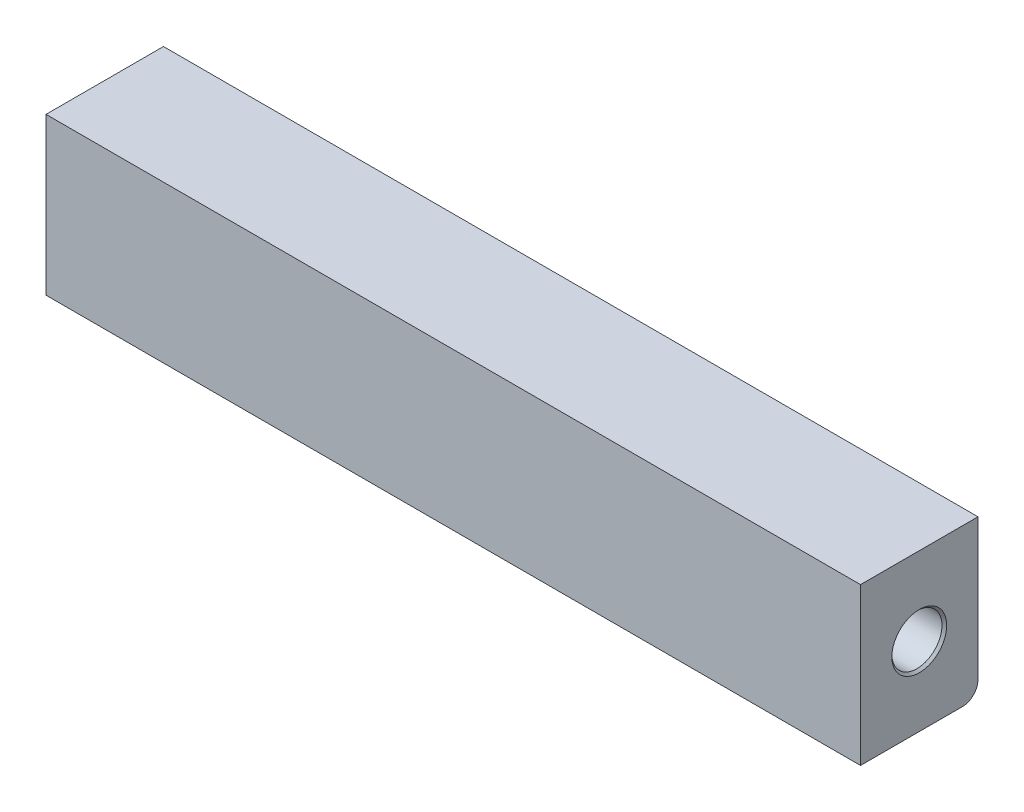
from build123d import *

# Parameters (mm, degrees)
SCHIZZO2_W                     = 104
SCHIZZO2_H                     = 15
ESTRUSIONE_ESTRUSIONE1_DEPTH   = 20
RACCORDO1_R                    = 2
FORO_PER_VITE_M6_1_D           = 6.4
FORO_PER_VITE_M6_1_DEPTH       = 30
FORO_PER_VITE_M6_1_CSINK_D     = 7
FORO_PER_VITE_M6_1_CSINK_ANGLE = 90
FORO_PER_VITE_M6_1_TIP         = 1.922753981
FORO_PER_VITE_M6_2_D           = 6.4
FORO_PER_VITE_M6_2_DEPTH       = 30
FORO_PER_VITE_M6_2_CSINK_D     = 7
FORO_PER_VITE_M6_2_CSINK_ANGLE = 90
FORO_PER_VITE_M6_2_TIP         = 1.922753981


with BuildPart() as part:
    # Schizzo2 → Estrusione-Estrusione1 (new body)
    with BuildSketch(Plane(origin=(0, 0, 0), x_dir=(1, 0, 0), z_dir=(0, 1, 0))):
        Rectangle(SCHIZZO2_W, SCHIZZO2_H)
    extrude(amount=ESTRUSIONE_ESTRUSIONE1_DEPTH)

    # Raccordo1
    raccordo1_edges = [part.edges().sort_by_distance(p)[0] for p in [
        (0, 0, -7.5),
    ]]
    fillet(raccordo1_edges, radius=RACCORDO1_R)

    # Foro per Vite M6-1
    with Locations(Plane.ZY.offset(52)):
        with Locations((0, 10)):
            CounterSinkHole(FORO_PER_VITE_M6_1_D / 2, FORO_PER_VITE_M6_1_CSINK_D / 2, depth=FORO_PER_VITE_M6_1_DEPTH, counter_sink_angle=FORO_PER_VITE_M6_1_CSINK_ANGLE)
            with Locations((0, 0, -(FORO_PER_VITE_M6_1_DEPTH + FORO_PER_VITE_M6_1_TIP / 2))):  # 118° drill point
                Cone(0, FORO_PER_VITE_M6_1_D / 2, FORO_PER_VITE_M6_1_TIP, mode=Mode.SUBTRACT)

    # Foro per Vite M6-2
    with Locations(Plane(origin=(52, 0, 0), x_dir=(0, 0, -1), z_dir=(1, 0, 0))):
        with Locations((0, 10)):
            CounterSinkHole(FORO_PER_VITE_M6_2_D / 2, FORO_PER_VITE_M6_2_CSINK_D / 2, depth=FORO_PER_VITE_M6_2_DEPTH, counter_sink_angle=FORO_PER_VITE_M6_2_CSINK_ANGLE)
            with Locations((0, 0, -(FORO_PER_VITE_M6_2_DEPTH + FORO_PER_VITE_M6_2_TIP / 2))):  # 118° drill point
                Cone(0, FORO_PER_VITE_M6_2_D / 2, FORO_PER_VITE_M6_2_TIP, mode=Mode.SUBTRACT)


solid = part.part
